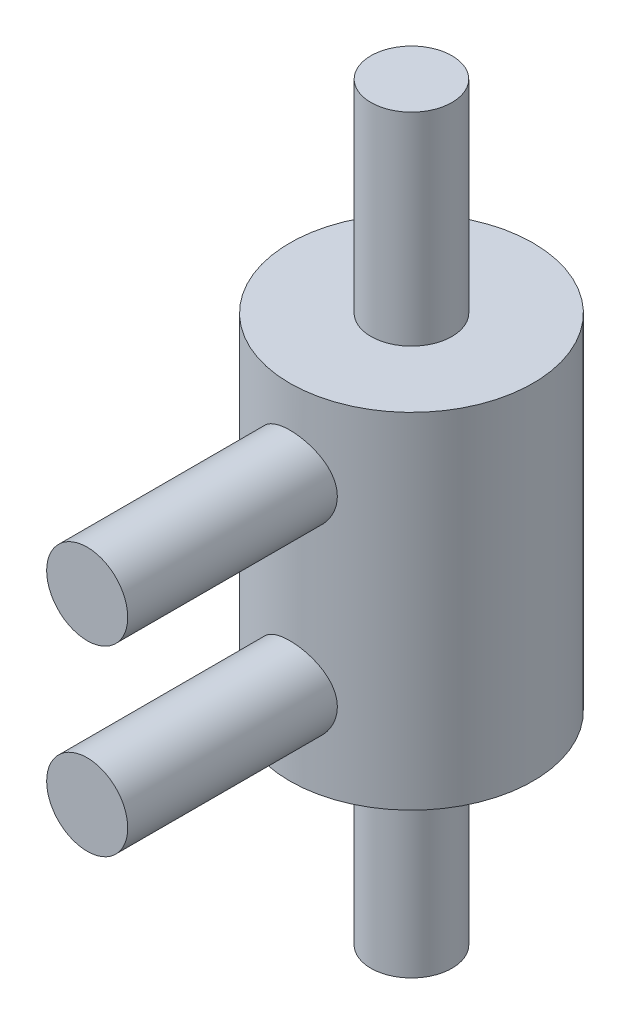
ISO-10303-21;
HEADER;
FILE_DESCRIPTION(('STEP AP214'),'2;1');
FILE_NAME('part.step','',(''),(''),'','','');
FILE_SCHEMA(('AUTOMOTIVE_DESIGN { 1 0 10303 214 1 1 1 1 }'));
ENDSEC;
DATA;
#1=APPLICATION_CONTEXT('core data for automotive mechanical design processes');
#2=APPLICATION_PROTOCOL_DEFINITION('international standard','automotive_design',2000,#1);
#3=PRODUCT_CONTEXT('',#1,'mechanical');
#4=PRODUCT('Part','Part','',(#3));
#5=PRODUCT_RELATED_PRODUCT_CATEGORY('part','',(#4));
#6=PRODUCT_DEFINITION_FORMATION('','',#4);
#7=PRODUCT_DEFINITION_CONTEXT('part definition',#1,'design');
#8=PRODUCT_DEFINITION('design','',#6,#7);
#9=PRODUCT_DEFINITION_SHAPE('','',#8);
#10=(LENGTH_UNIT() NAMED_UNIT(*) SI_UNIT(.MILLI.,.METRE.));
#11=(NAMED_UNIT(*) PLANE_ANGLE_UNIT() SI_UNIT($,.RADIAN.));
#12=(NAMED_UNIT(*) SI_UNIT($,.STERADIAN.) SOLID_ANGLE_UNIT());
#13=UNCERTAINTY_MEASURE_WITH_UNIT(LENGTH_MEASURE(1.E-05),#10,'distance_accuracy_value','');
#14=(GEOMETRIC_REPRESENTATION_CONTEXT(3) GLOBAL_UNCERTAINTY_ASSIGNED_CONTEXT((#13)) GLOBAL_UNIT_ASSIGNED_CONTEXT((#10,
#11,#12)) REPRESENTATION_CONTEXT('',''));
#15=CARTESIAN_POINT('',(0.,0.,0.));
#16=DIRECTION('',(0.,0.,1.));
#17=DIRECTION('',(1.,0.,0.));
#18=AXIS2_PLACEMENT_3D('',#15,#16,#17);
#19=CARTESIAN_POINT('',(0.,17.,0.));
#20=DIRECTION('',(0.,-1.,0.));
#21=DIRECTION('',(0.,0.,-1.));
#22=AXIS2_PLACEMENT_3D('',#19,#20,#21);
#23=CYLINDRICAL_SURFACE('',#22,6.);
#24=CARTESIAN_POINT('',(-2.,4.,5.65685424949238));
#25=CARTESIAN_POINT('',(-2.00000051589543,4.10893634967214,5.65685389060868));
#26=CARTESIAN_POINT('',(-1.99106956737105,4.21786959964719,5.66003538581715));
#27=CARTESIAN_POINT('',(-1.95570226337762,4.4325088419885,5.67235148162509));
#28=CARTESIAN_POINT('',(-1.92926302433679,4.53821429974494,5.68148706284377));
#29=CARTESIAN_POINT('',(-1.85991097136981,4.74325378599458,5.70456407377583));
#30=CARTESIAN_POINT('',(-1.81703044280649,4.84259985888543,5.71849607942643));
#31=CARTESIAN_POINT('',(-1.71612325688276,5.03272009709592,5.74958244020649));
#32=CARTESIAN_POINT('',(-1.65809325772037,5.12349236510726,5.76673750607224));
#33=CARTESIAN_POINT('',(-1.52610229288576,5.29743992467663,5.80308978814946));
#34=CARTESIAN_POINT('',(-1.45164868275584,5.38023085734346,5.82233789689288));
#35=CARTESIAN_POINT('',(-1.28997533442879,5.53241360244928,5.86027729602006));
#36=CARTESIAN_POINT('',(-1.20275355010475,5.60180326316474,5.87896849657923));
#37=CARTESIAN_POINT('',(-1.01520901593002,5.72695779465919,5.91427733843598));
#38=CARTESIAN_POINT('',(-0.914603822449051,5.78231994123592,5.93082815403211));
#39=CARTESIAN_POINT('',(-0.704862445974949,5.87518317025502,5.95939173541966));
#40=CARTESIAN_POINT('',(-0.595728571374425,5.91268906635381,5.97140572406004));
#41=CARTESIAN_POINT('',(-0.37605763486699,5.96747170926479,5.98918150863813));
#42=CARTESIAN_POINT('',(-0.265701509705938,5.98540689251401,5.99514629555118));
#43=CARTESIAN_POINT('',(-0.0433957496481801,6.00263258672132,6.00087216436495));
#44=CARTESIAN_POINT('',(0.0685534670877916,6.00192790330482,6.00063484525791));
#45=CARTESIAN_POINT('',(0.286207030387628,5.98231149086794,5.99412079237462));
#46=CARTESIAN_POINT('',(0.391984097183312,5.96411494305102,5.98808129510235));
#47=CARTESIAN_POINT('',(0.598886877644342,5.91121403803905,5.97093934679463));
#48=CARTESIAN_POINT('',(0.70001227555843,5.87650856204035,5.95983655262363));
#49=CARTESIAN_POINT('',(0.896304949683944,5.79115736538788,5.93351340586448));
#50=CARTESIAN_POINT('',(0.991376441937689,5.74030812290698,5.91824085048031));
#51=CARTESIAN_POINT('',(1.17184865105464,5.62428058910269,5.88516786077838));
#52=CARTESIAN_POINT('',(1.25724666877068,5.55909831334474,5.86736672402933));
#53=CARTESIAN_POINT('',(1.42020173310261,5.4126512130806,5.83012383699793));
#54=CARTESIAN_POINT('',(1.49720031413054,5.33077368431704,5.81064430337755));
#55=CARTESIAN_POINT('',(1.63655451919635,5.15510254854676,5.77294670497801));
#56=CARTESIAN_POINT('',(1.69890788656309,5.06130710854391,5.75472883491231));
#57=CARTESIAN_POINT('',(1.80797491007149,4.86269274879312,5.72141050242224));
#58=CARTESIAN_POINT('',(1.85445292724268,4.75773573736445,5.70635818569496));
#59=CARTESIAN_POINT('',(1.92888638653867,4.54085721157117,5.68163301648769));
#60=CARTESIAN_POINT('',(1.95684959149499,4.42893863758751,5.67195790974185));
#61=CARTESIAN_POINT('',(1.99232256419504,4.20672328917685,5.6595927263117));
#62=CARTESIAN_POINT('',(2.00069819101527,4.09658115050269,5.65660720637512));
#63=CARTESIAN_POINT('',(1.99921087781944,3.87644770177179,5.65713344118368));
#64=CARTESIAN_POINT('',(1.98935125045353,3.76645636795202,5.66064401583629));
#65=CARTESIAN_POINT('',(1.95245130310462,3.55368606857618,5.67347236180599));
#66=CARTESIAN_POINT('',(1.92601278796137,3.45078913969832,5.6825865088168));
#67=CARTESIAN_POINT('',(1.85742772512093,3.25091278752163,5.70537107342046));
#68=CARTESIAN_POINT('',(1.81527839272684,3.15393441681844,5.71904229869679));
#69=CARTESIAN_POINT('',(1.71494868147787,2.96523915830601,5.74993755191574));
#70=CARTESIAN_POINT('',(1.65630223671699,2.8737867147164,5.76726051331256));
#71=CARTESIAN_POINT('',(1.52517126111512,2.70170789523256,5.8033153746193));
#72=CARTESIAN_POINT('',(1.45268265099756,2.62108472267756,5.82204768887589));
#73=CARTESIAN_POINT('',(1.29178341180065,2.46894403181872,5.85990077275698));
#74=CARTESIAN_POINT('',(1.20277454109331,2.3980512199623,5.87899687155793));
#75=CARTESIAN_POINT('',(1.01365458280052,2.27216771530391,5.91453703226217));
#76=CARTESIAN_POINT('',(0.913543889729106,2.21717645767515,5.93098118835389));
#77=CARTESIAN_POINT('',(0.705559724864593,2.12515979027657,5.95928811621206));
#78=CARTESIAN_POINT('',(0.597742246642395,2.08801744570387,5.97118060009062));
#79=CARTESIAN_POINT('',(0.376916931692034,2.03254451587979,5.98917221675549));
#80=CARTESIAN_POINT('',(0.26391098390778,2.01420714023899,5.99527344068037));
#81=CARTESIAN_POINT('',(0.0416306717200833,1.99747584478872,6.00083726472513));
#82=CARTESIAN_POINT('',(-0.0675694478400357,1.99818509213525,6.00059840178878));
#83=CARTESIAN_POINT('',(-0.284222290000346,2.01731461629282,5.99424393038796));
#84=CARTESIAN_POINT('',(-0.391675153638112,2.03573345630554,5.98812879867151));
#85=CARTESIAN_POINT('',(-0.600084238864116,2.08916446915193,5.97081829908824));
#86=CARTESIAN_POINT('',(-0.701116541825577,2.12390843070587,5.95970516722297));
#87=CARTESIAN_POINT('',(-0.89595670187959,2.20875506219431,5.9335432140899));
#88=CARTESIAN_POINT('',(-0.989763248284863,2.25886051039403,5.91849368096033));
#89=CARTESIAN_POINT('',(-1.17126803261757,2.37513902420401,5.88531737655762));
#90=CARTESIAN_POINT('',(-1.25861250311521,2.44183737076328,5.86709744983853));
#91=CARTESIAN_POINT('',(-1.42116205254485,2.58851478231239,5.82985977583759));
#92=CARTESIAN_POINT('',(-1.49636324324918,2.66849808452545,5.81084177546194));
#93=CARTESIAN_POINT('',(-1.63548361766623,2.8432187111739,5.77326559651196));
#94=CARTESIAN_POINT('',(-1.6988459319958,2.93841102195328,5.75475455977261));
#95=CARTESIAN_POINT('',(-1.80862868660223,3.13866885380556,5.7212038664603));
#96=CARTESIAN_POINT('',(-1.85505355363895,3.24373178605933,5.70616330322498));
#97=CARTESIAN_POINT('',(-1.92768765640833,3.45592364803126,5.68202668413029));
#98=CARTESIAN_POINT('',(-1.95471581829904,3.56274452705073,5.67269265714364));
#99=CARTESIAN_POINT('',(-1.99086864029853,3.7797121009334,5.66010767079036));
#100=CARTESIAN_POINT('',(-1.99999947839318,3.88985763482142,5.65685461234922));
#101=CARTESIAN_POINT('',(-2.,4.,5.65685424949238));
#102=B_SPLINE_CURVE_WITH_KNOTS('',3,(#24,#25,#26,#27,#28,#29,#30,#31,#32,#33,#34,#35,#36,#37,
#38,#39,#40,#41,#42,#43,#44,#45,#46,#47,#48,#49,#50,#51,#52,#53,#54,#55,#56,#57,#58,#59,#60,#61,
#62,#63,#64,#65,#66,#67,#68,#69,#70,#71,#72,#73,#74,#75,#76,#77,#78,#79,#80,#81,#82,#83,#84,#85,
#86,#87,#88,#89,#90,#91,#92,#93,#94,#95,#96,#97,#98,#99,#100,#101),.UNSPECIFIED.,.T.,.F.,(4,2,2,
2,2,2,2,2,2,2,2,2,2,2,2,2,2,2,2,2,2,2,2,2,2,2,2,2,2,2,2,2,2,2,2,2,2,2,4),(0.,0.326401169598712,
0.652856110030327,0.978673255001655,1.30456233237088,1.64202674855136,1.97954530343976,
2.32587012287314,2.67210152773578,3.00628637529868,3.34038506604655,3.66138009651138,
3.98239688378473,4.3076330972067,4.63295983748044,4.97360348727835,5.31429959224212,
5.65985279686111,6.00526102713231,6.33508582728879,6.66485071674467,6.98328791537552,
7.30178158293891,7.6303771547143,7.95906971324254,8.30357616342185,8.64807037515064,
8.99027582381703,9.33235766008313,9.6583616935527,9.98433928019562,10.3051391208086,
10.6259970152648,10.9587103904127,11.2915300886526,11.6373780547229,11.9831355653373,
12.3132642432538,12.6432789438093),.UNSPECIFIED.);
#103=CARTESIAN_POINT('',(-2.,4.,5.65685424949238));
#104=VERTEX_POINT('',#103);
#105=EDGE_CURVE('E43',#104,#104,#102,.T.);
#106=ORIENTED_EDGE('',*,*,#105,.T.);
#107=EDGE_LOOP('',(#106));
#108=FACE_BOUND('',#107,.T.);
#109=CARTESIAN_POINT('',(0.,17.,0.));
#110=DIRECTION('',(0.,1.,0.));
#111=DIRECTION('',(0.,0.,1.));
#112=AXIS2_PLACEMENT_3D('',#109,#110,#111);
#113=CIRCLE('',#112,6.);
#114=CARTESIAN_POINT('',(0.,17.,6.));
#115=VERTEX_POINT('',#114);
#116=EDGE_CURVE('E55',#115,#115,#113,.T.);
#117=ORIENTED_EDGE('',*,*,#116,.F.);
#118=EDGE_LOOP('',(#117));
#119=FACE_BOUND('',#118,.T.);
#120=CARTESIAN_POINT('',(0.,0.,0.));
#121=DIRECTION('',(0.,1.,0.));
#122=DIRECTION('',(0.,0.,1.));
#123=AXIS2_PLACEMENT_3D('',#120,#121,#122);
#124=CIRCLE('',#123,6.);
#125=CARTESIAN_POINT('',(0.,0.,6.));
#126=VERTEX_POINT('',#125);
#127=EDGE_CURVE('E62',#126,#126,#124,.T.);
#128=ORIENTED_EDGE('',*,*,#127,.T.);
#129=EDGE_LOOP('',(#128));
#130=FACE_BOUND('',#129,.T.);
#131=CARTESIAN_POINT('',(-2.,13.,5.65685424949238));
#132=CARTESIAN_POINT('',(-2.00000051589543,12.8910636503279,5.65685389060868));
#133=CARTESIAN_POINT('',(-1.99106956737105,12.7821304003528,5.66003538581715));
#134=CARTESIAN_POINT('',(-1.95570226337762,12.5674911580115,5.67235148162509));
#135=CARTESIAN_POINT('',(-1.92926302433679,12.4617857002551,5.68148706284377));
#136=CARTESIAN_POINT('',(-1.85991097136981,12.2567462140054,5.70456407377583));
#137=CARTESIAN_POINT('',(-1.81703044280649,12.1574001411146,5.71849607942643));
#138=CARTESIAN_POINT('',(-1.71612325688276,11.9672799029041,5.74958244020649));
#139=CARTESIAN_POINT('',(-1.65809325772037,11.8765076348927,5.76673750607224));
#140=CARTESIAN_POINT('',(-1.52610229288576,11.7025600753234,5.80308978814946));
#141=CARTESIAN_POINT('',(-1.45164868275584,11.6197691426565,5.82233789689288));
#142=CARTESIAN_POINT('',(-1.28997533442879,11.4675863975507,5.86027729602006));
#143=CARTESIAN_POINT('',(-1.20275355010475,11.3981967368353,5.87896849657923));
#144=CARTESIAN_POINT('',(-1.01520901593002,11.2730422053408,5.91427733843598));
#145=CARTESIAN_POINT('',(-0.914603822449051,11.2176800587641,5.93082815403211));
#146=CARTESIAN_POINT('',(-0.704862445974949,11.124816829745,5.95939173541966));
#147=CARTESIAN_POINT('',(-0.595728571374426,11.0873109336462,5.97140572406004));
#148=CARTESIAN_POINT('',(-0.376057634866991,11.0325282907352,5.98918150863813));
#149=CARTESIAN_POINT('',(-0.265701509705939,11.014593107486,5.99514629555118));
#150=CARTESIAN_POINT('',(-0.0433957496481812,10.9973674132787,6.00087216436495));
#151=CARTESIAN_POINT('',(0.0685534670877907,10.9980720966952,6.00063484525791));
#152=CARTESIAN_POINT('',(0.286207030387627,11.0176885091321,5.99412079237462));
#153=CARTESIAN_POINT('',(0.391984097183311,11.035885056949,5.98808129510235));
#154=CARTESIAN_POINT('',(0.598886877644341,11.0887859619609,5.97093934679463));
#155=CARTESIAN_POINT('',(0.70001227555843,11.1234914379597,5.95983655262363));
#156=CARTESIAN_POINT('',(0.896304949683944,11.2088426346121,5.93351340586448));
#157=CARTESIAN_POINT('',(0.991376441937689,11.259691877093,5.91824085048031));
#158=CARTESIAN_POINT('',(1.17184865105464,11.3757194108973,5.88516786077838));
#159=CARTESIAN_POINT('',(1.25724666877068,11.4409016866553,5.86736672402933));
#160=CARTESIAN_POINT('',(1.42020173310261,11.5873487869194,5.83012383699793));
#161=CARTESIAN_POINT('',(1.49720031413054,11.669226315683,5.81064430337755));
#162=CARTESIAN_POINT('',(1.63655451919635,11.8448974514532,5.77294670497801));
#163=CARTESIAN_POINT('',(1.69890788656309,11.9386928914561,5.75472883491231));
#164=CARTESIAN_POINT('',(1.80797491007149,12.1373072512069,5.72141050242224));
#165=CARTESIAN_POINT('',(1.85445292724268,12.2422642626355,5.70635818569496));
#166=CARTESIAN_POINT('',(1.92888638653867,12.4591427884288,5.68163301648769));
#167=CARTESIAN_POINT('',(1.95684959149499,12.5710613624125,5.67195790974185));
#168=CARTESIAN_POINT('',(1.99232256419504,12.7932767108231,5.6595927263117));
#169=CARTESIAN_POINT('',(2.00069819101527,12.9034188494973,5.65660720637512));
#170=CARTESIAN_POINT('',(1.99921087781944,13.1235522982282,5.65713344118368));
#171=CARTESIAN_POINT('',(1.98935125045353,13.233543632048,5.66064401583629));
#172=CARTESIAN_POINT('',(1.95245130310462,13.4463139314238,5.67347236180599));
#173=CARTESIAN_POINT('',(1.92601278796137,13.5492108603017,5.6825865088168));
#174=CARTESIAN_POINT('',(1.85742772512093,13.7490872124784,5.70537107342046));
#175=CARTESIAN_POINT('',(1.81527839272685,13.8460655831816,5.71904229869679));
#176=CARTESIAN_POINT('',(1.71494868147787,14.034760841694,5.74993755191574));
#177=CARTESIAN_POINT('',(1.65630223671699,14.1262132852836,5.76726051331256));
#178=CARTESIAN_POINT('',(1.52517126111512,14.2982921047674,5.8033153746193));
#179=CARTESIAN_POINT('',(1.45268265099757,14.3789152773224,5.82204768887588));
#180=CARTESIAN_POINT('',(1.29178341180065,14.5310559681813,5.85990077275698));
#181=CARTESIAN_POINT('',(1.20277454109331,14.6019487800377,5.87899687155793));
#182=CARTESIAN_POINT('',(1.01365458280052,14.7278322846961,5.91453703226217));
#183=CARTESIAN_POINT('',(0.913543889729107,14.7828235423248,5.93098118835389));
#184=CARTESIAN_POINT('',(0.705559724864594,14.8748402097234,5.95928811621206));
#185=CARTESIAN_POINT('',(0.597742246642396,14.9119825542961,5.97118060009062));
#186=CARTESIAN_POINT('',(0.376916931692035,14.9674554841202,5.98917221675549));
#187=CARTESIAN_POINT('',(0.263910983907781,14.985792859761,5.99527344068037));
#188=CARTESIAN_POINT('',(0.0416306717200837,15.0025241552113,6.00083726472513));
#189=CARTESIAN_POINT('',(-0.0675694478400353,15.0018149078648,6.00059840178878));
#190=CARTESIAN_POINT('',(-0.284222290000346,14.9826853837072,5.99424393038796));
#191=CARTESIAN_POINT('',(-0.391675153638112,14.9642665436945,5.98812879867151));
#192=CARTESIAN_POINT('',(-0.600084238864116,14.9108355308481,5.97081829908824));
#193=CARTESIAN_POINT('',(-0.701116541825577,14.8760915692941,5.95970516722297));
#194=CARTESIAN_POINT('',(-0.895956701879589,14.7912449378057,5.9335432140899));
#195=CARTESIAN_POINT('',(-0.989763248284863,14.741139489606,5.91849368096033));
#196=CARTESIAN_POINT('',(-1.17126803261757,14.624860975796,5.88531737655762));
#197=CARTESIAN_POINT('',(-1.25861250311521,14.5581626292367,5.86709744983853));
#198=CARTESIAN_POINT('',(-1.42116205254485,14.4114852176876,5.82985977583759));
#199=CARTESIAN_POINT('',(-1.49636324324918,14.3315019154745,5.81084177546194));
#200=CARTESIAN_POINT('',(-1.63548361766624,14.1567812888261,5.77326559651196));
#201=CARTESIAN_POINT('',(-1.6988459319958,14.0615889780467,5.75475455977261));
#202=CARTESIAN_POINT('',(-1.80862868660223,13.8613311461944,5.7212038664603));
#203=CARTESIAN_POINT('',(-1.85505355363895,13.7562682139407,5.70616330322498));
#204=CARTESIAN_POINT('',(-1.92768765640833,13.5440763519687,5.68202668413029));
#205=CARTESIAN_POINT('',(-1.95471581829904,13.4372554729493,5.67269265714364));
#206=CARTESIAN_POINT('',(-1.99086864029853,13.2202878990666,5.66010767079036));
#207=CARTESIAN_POINT('',(-1.99999947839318,13.1101423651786,5.65685461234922));
#208=CARTESIAN_POINT('',(-2.,13.,5.65685424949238));
#209=B_SPLINE_CURVE_WITH_KNOTS('',3,(#131,#132,#133,#134,#135,#136,#137,#138,#139,#140,#141,
#142,#143,#144,#145,#146,#147,#148,#149,#150,#151,#152,#153,#154,#155,#156,#157,#158,#159,#160,
#161,#162,#163,#164,#165,#166,#167,#168,#169,#170,#171,#172,#173,#174,#175,#176,#177,#178,#179,
#180,#181,#182,#183,#184,#185,#186,#187,#188,#189,#190,#191,#192,#193,#194,#195,#196,#197,#198,
#199,#200,#201,#202,#203,#204,#205,#206,#207,#208),.UNSPECIFIED.,.T.,.F.,(4,2,2,2,2,2,2,2,2,2,2,
2,2,2,2,2,2,2,2,2,2,2,2,2,2,2,2,2,2,2,2,2,2,2,2,2,2,2,4),(0.,0.326401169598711,
0.652856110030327,0.978673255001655,1.30456233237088,1.64202674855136,1.97954530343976,
2.32587012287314,2.67210152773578,3.00628637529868,3.34038506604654,3.66138009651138,
3.98239688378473,4.3076330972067,4.63295983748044,4.97360348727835,5.31429959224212,
5.65985279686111,6.00526102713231,6.33508582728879,6.66485071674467,6.98328791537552,
7.30178158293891,7.63037715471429,7.95906971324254,8.30357616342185,8.64807037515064,
8.99027582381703,9.33235766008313,9.65836169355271,9.98433928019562,10.3051391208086,
10.6259970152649,10.9587103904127,11.2915300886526,11.6373780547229,11.9831355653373,
12.3132642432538,12.6432789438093),.UNSPECIFIED.);
#210=CARTESIAN_POINT('',(-2.,13.,5.65685424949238));
#211=VERTEX_POINT('',#210);
#212=EDGE_CURVE('E10',#211,#211,#209,.T.);
#213=ORIENTED_EDGE('',*,*,#212,.F.);
#214=EDGE_LOOP('',(#213));
#215=FACE_BOUND('',#214,.T.);
#216=ADVANCED_FACE('F39',(#108,#119,#130,#215),#23,.T.);
#217=CARTESIAN_POINT('',(0.,17.,0.));
#218=DIRECTION('',(0.,1.,0.));
#219=DIRECTION('',(0.,0.,1.));
#220=AXIS2_PLACEMENT_3D('',#217,#218,#219);
#221=PLANE('',#220);
#222=CARTESIAN_POINT('',(0.,17.,0.));
#223=DIRECTION('',(0.,1.,0.));
#224=DIRECTION('',(0.,0.,1.));
#225=AXIS2_PLACEMENT_3D('',#222,#223,#224);
#226=CIRCLE('',#225,2.);
#227=CARTESIAN_POINT('',(0.,17.,2.));
#228=VERTEX_POINT('',#227);
#229=EDGE_CURVE('E51',#228,#228,#226,.T.);
#230=ORIENTED_EDGE('',*,*,#229,.F.);
#231=EDGE_LOOP('',(#230));
#232=FACE_BOUND('',#231,.T.);
#233=ORIENTED_EDGE('',*,*,#116,.T.);
#234=EDGE_LOOP('',(#233));
#235=FACE_BOUND('',#234,.T.);
#236=ADVANCED_FACE('F81',(#232,#235),#221,.T.);
#237=CARTESIAN_POINT('',(0.,0.,0.));
#238=DIRECTION('',(0.,1.,0.));
#239=DIRECTION('',(0.,0.,1.));
#240=AXIS2_PLACEMENT_3D('',#237,#238,#239);
#241=PLANE('',#240);
#242=CARTESIAN_POINT('',(0.,0.,0.));
#243=DIRECTION('',(0.,1.,0.));
#244=DIRECTION('',(0.,0.,1.));
#245=AXIS2_PLACEMENT_3D('',#242,#243,#244);
#246=CIRCLE('',#245,2.);
#247=CARTESIAN_POINT('',(0.,0.,2.));
#248=VERTEX_POINT('',#247);
#249=EDGE_CURVE('E114',#248,#248,#246,.T.);
#250=ORIENTED_EDGE('',*,*,#249,.T.);
#251=EDGE_LOOP('',(#250));
#252=FACE_BOUND('',#251,.T.);
#253=ORIENTED_EDGE('',*,*,#127,.F.);
#254=EDGE_LOOP('',(#253));
#255=FACE_BOUND('',#254,.T.);
#256=ADVANCED_FACE('F79',(#252,#255),#241,.F.);
#257=CARTESIAN_POINT('',(0.,27.,0.));
#258=DIRECTION('',(0.,-1.,0.));
#259=DIRECTION('',(0.,0.,-1.));
#260=AXIS2_PLACEMENT_3D('',#257,#258,#259);
#261=CYLINDRICAL_SURFACE('',#260,2.);
#262=CARTESIAN_POINT('',(0.,27.,0.));
#263=DIRECTION('',(0.,1.,0.));
#264=DIRECTION('',(0.,0.,1.));
#265=AXIS2_PLACEMENT_3D('',#262,#263,#264);
#266=CIRCLE('',#265,2.);
#267=CARTESIAN_POINT('',(0.,27.,2.));
#268=VERTEX_POINT('',#267);
#269=EDGE_CURVE('E105',#268,#268,#266,.T.);
#270=ORIENTED_EDGE('',*,*,#269,.F.);
#271=EDGE_LOOP('',(#270));
#272=FACE_BOUND('',#271,.T.);
#273=ORIENTED_EDGE('',*,*,#229,.T.);
#274=EDGE_LOOP('',(#273));
#275=FACE_BOUND('',#274,.T.);
#276=ADVANCED_FACE('F75',(#272,#275),#261,.T.);
#277=CARTESIAN_POINT('',(0.,27.,0.));
#278=DIRECTION('',(0.,1.,0.));
#279=DIRECTION('',(0.,0.,1.));
#280=AXIS2_PLACEMENT_3D('',#277,#278,#279);
#281=PLANE('',#280);
#282=ORIENTED_EDGE('',*,*,#269,.T.);
#283=EDGE_LOOP('',(#282));
#284=FACE_BOUND('',#283,.T.);
#285=ADVANCED_FACE('F70',(#284),#281,.T.);
#286=CARTESIAN_POINT('',(0.,13.,16.));
#287=DIRECTION('',(0.,0.,-1.));
#288=DIRECTION('',(-1.,0.,0.));
#289=AXIS2_PLACEMENT_3D('',#286,#287,#288);
#290=CYLINDRICAL_SURFACE('',#289,2.);
#291=CARTESIAN_POINT('',(0.,13.,16.));
#292=DIRECTION('',(0.,0.,1.));
#293=DIRECTION('',(1.,0.,0.));
#294=AXIS2_PLACEMENT_3D('',#291,#292,#293);
#295=CIRCLE('',#294,2.);
#296=CARTESIAN_POINT('',(2.,13.,16.));
#297=VERTEX_POINT('',#296);
#298=EDGE_CURVE('E107',#297,#297,#295,.T.);
#299=ORIENTED_EDGE('',*,*,#298,.F.);
#300=EDGE_LOOP('',(#299));
#301=FACE_BOUND('',#300,.T.);
#302=ORIENTED_EDGE('',*,*,#212,.T.);
#303=EDGE_LOOP('',(#302));
#304=FACE_BOUND('',#303,.T.);
#305=ADVANCED_FACE('F64',(#301,#304),#290,.T.);
#306=CARTESIAN_POINT('',(0.,13.,16.));
#307=DIRECTION('',(0.,0.,1.));
#308=DIRECTION('',(1.,0.,0.));
#309=AXIS2_PLACEMENT_3D('',#306,#307,#308);
#310=PLANE('',#309);
#311=ORIENTED_EDGE('',*,*,#298,.T.);
#312=EDGE_LOOP('',(#311));
#313=FACE_BOUND('',#312,.T.);
#314=ADVANCED_FACE('F69',(#313),#310,.T.);
#315=CARTESIAN_POINT('',(0.,-10.,0.));
#316=DIRECTION('',(0.,1.,0.));
#317=DIRECTION('',(0.,0.,1.));
#318=AXIS2_PLACEMENT_3D('',#315,#316,#317);
#319=CYLINDRICAL_SURFACE('',#318,2.);
#320=CARTESIAN_POINT('',(0.,-10.,0.));
#321=DIRECTION('',(0.,1.,0.));
#322=DIRECTION('',(0.,0.,1.));
#323=AXIS2_PLACEMENT_3D('',#320,#321,#322);
#324=CIRCLE('',#323,2.);
#325=CARTESIAN_POINT('',(0.,-10.,2.));
#326=VERTEX_POINT('',#325);
#327=EDGE_CURVE('E111',#326,#326,#324,.T.);
#328=ORIENTED_EDGE('',*,*,#327,.T.);
#329=EDGE_LOOP('',(#328));
#330=FACE_BOUND('',#329,.T.);
#331=ORIENTED_EDGE('',*,*,#249,.F.);
#332=EDGE_LOOP('',(#331));
#333=FACE_BOUND('',#332,.T.);
#334=ADVANCED_FACE('F135',(#330,#333),#319,.T.);
#335=CARTESIAN_POINT('',(0.,-10.,0.));
#336=DIRECTION('',(0.,-1.,0.));
#337=DIRECTION('',(0.,0.,1.));
#338=AXIS2_PLACEMENT_3D('',#335,#336,#337);
#339=PLANE('',#338);
#340=ORIENTED_EDGE('',*,*,#327,.F.);
#341=EDGE_LOOP('',(#340));
#342=FACE_BOUND('',#341,.T.);
#343=ADVANCED_FACE('F131',(#342),#339,.T.);
#344=CARTESIAN_POINT('',(0.,4.,16.));
#345=DIRECTION('',(0.,0.,-1.));
#346=DIRECTION('',(-1.,0.,0.));
#347=AXIS2_PLACEMENT_3D('',#344,#345,#346);
#348=CYLINDRICAL_SURFACE('',#347,2.);
#349=CARTESIAN_POINT('',(0.,4.,16.));
#350=DIRECTION('',(0.,0.,-1.));
#351=DIRECTION('',(1.,0.,0.));
#352=AXIS2_PLACEMENT_3D('',#349,#350,#351);
#353=CIRCLE('',#352,2.);
#354=CARTESIAN_POINT('',(2.,4.,16.));
#355=VERTEX_POINT('',#354);
#356=EDGE_CURVE('E118',#355,#355,#353,.T.);
#357=ORIENTED_EDGE('',*,*,#356,.T.);
#358=EDGE_LOOP('',(#357));
#359=FACE_BOUND('',#358,.T.);
#360=ORIENTED_EDGE('',*,*,#105,.F.);
#361=EDGE_LOOP('',(#360));
#362=FACE_BOUND('',#361,.T.);
#363=ADVANCED_FACE('F122',(#359,#362),#348,.T.);
#364=CARTESIAN_POINT('',(0.,4.,16.));
#365=DIRECTION('',(0.,0.,1.));
#366=DIRECTION('',(1.,0.,0.));
#367=AXIS2_PLACEMENT_3D('',#364,#365,#366);
#368=PLANE('',#367);
#369=ORIENTED_EDGE('',*,*,#356,.F.);
#370=EDGE_LOOP('',(#369));
#371=FACE_BOUND('',#370,.T.);
#372=ADVANCED_FACE('F125',(#371),#368,.T.);
#373=CLOSED_SHELL('',(#216,#236,#256,#276,#285,#305,#314,#334,#343,#363,#372));
#374=MANIFOLD_SOLID_BREP('B2',#373);
#375=ADVANCED_BREP_SHAPE_REPRESENTATION('',(#18,#374),#14);
#376=SHAPE_DEFINITION_REPRESENTATION(#9,#375);
ENDSEC;
END-ISO-10303-21;
